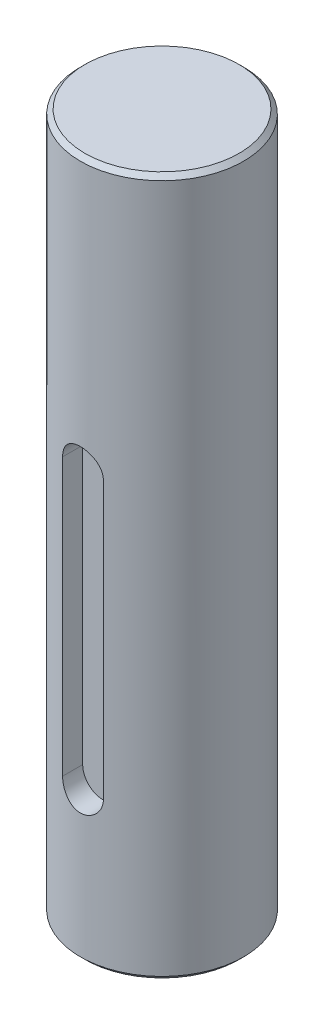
ISO-10303-21;
HEADER;
FILE_DESCRIPTION(('STEP AP214'),'2;1');
FILE_NAME('part.step','',(''),(''),'','','');
FILE_SCHEMA(('AUTOMOTIVE_DESIGN { 1 0 10303 214 1 1 1 1 }'));
ENDSEC;
DATA;
#1=APPLICATION_CONTEXT('core data for automotive mechanical design processes');
#2=APPLICATION_PROTOCOL_DEFINITION('international standard','automotive_design',2000,#1);
#3=PRODUCT_CONTEXT('',#1,'mechanical');
#4=PRODUCT('Part','Part','',(#3));
#5=PRODUCT_RELATED_PRODUCT_CATEGORY('part','',(#4));
#6=PRODUCT_DEFINITION_FORMATION('','',#4);
#7=PRODUCT_DEFINITION_CONTEXT('part definition',#1,'design');
#8=PRODUCT_DEFINITION('design','',#6,#7);
#9=PRODUCT_DEFINITION_SHAPE('','',#8);
#10=(LENGTH_UNIT() NAMED_UNIT(*) SI_UNIT(.MILLI.,.METRE.));
#11=(NAMED_UNIT(*) PLANE_ANGLE_UNIT() SI_UNIT($,.RADIAN.));
#12=(NAMED_UNIT(*) SI_UNIT($,.STERADIAN.) SOLID_ANGLE_UNIT());
#13=UNCERTAINTY_MEASURE_WITH_UNIT(LENGTH_MEASURE(1.E-05),#10,'distance_accuracy_value','');
#14=(GEOMETRIC_REPRESENTATION_CONTEXT(3) GLOBAL_UNCERTAINTY_ASSIGNED_CONTEXT((#13)) GLOBAL_UNIT_ASSIGNED_CONTEXT((#10,
#11,#12)) REPRESENTATION_CONTEXT('',''));
#15=CARTESIAN_POINT('',(0.,0.,0.));
#16=DIRECTION('',(0.,0.,1.));
#17=DIRECTION('',(1.,0.,0.));
#18=AXIS2_PLACEMENT_3D('',#15,#16,#17);
#19=CARTESIAN_POINT('',(0.,154.,0.));
#20=DIRECTION('',(0.,-1.,0.));
#21=DIRECTION('',(0.,0.,-1.));
#22=AXIS2_PLACEMENT_3D('',#19,#20,#21);
#23=CYLINDRICAL_SURFACE('',#22,18.);
#24=CARTESIAN_POINT('',(0.,0.999999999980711,0.));
#25=DIRECTION('',(0.,-1.,0.));
#26=DIRECTION('',(0.,0.,-1.));
#27=AXIS2_PLACEMENT_3D('',#24,#25,#26);
#28=CIRCLE('',#27,18.);
#29=CARTESIAN_POINT('',(0.,0.999999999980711,-18.));
#30=VERTEX_POINT('',#29);
#31=EDGE_CURVE('E11',#30,#30,#28,.F.);
#32=ORIENTED_EDGE('',*,*,#31,.T.);
#33=EDGE_LOOP('',(#32));
#34=FACE_BOUND('',#33,.T.);
#35=CARTESIAN_POINT('',(0.,153.000000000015,0.));
#36=DIRECTION('',(0.,1.,0.));
#37=DIRECTION('',(0.,0.,1.));
#38=AXIS2_PLACEMENT_3D('',#35,#36,#37);
#39=CIRCLE('',#38,18.);
#40=CARTESIAN_POINT('',(0.,153.000000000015,18.));
#41=VERTEX_POINT('',#40);
#42=EDGE_CURVE('E84',#41,#41,#39,.F.);
#43=ORIENTED_EDGE('',*,*,#42,.T.);
#44=EDGE_LOOP('',(#43));
#45=FACE_BOUND('',#44,.T.);
#46=CARTESIAN_POINT('',(-4.5,94.,17.4284250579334));
#47=CARTESIAN_POINT('',(-4.5000156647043,94.1244458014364,17.4284107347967));
#48=CARTESIAN_POINT('',(-4.49483840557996,94.2488863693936,17.4297574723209));
#49=CARTESIAN_POINT('',(-4.47421375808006,94.4968369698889,17.4350686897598));
#50=CARTESIAN_POINT('',(-4.45876809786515,94.6203471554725,17.4390327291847));
#51=CARTESIAN_POINT('',(-4.41776283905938,94.8653171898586,17.4494639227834));
#52=CARTESIAN_POINT('',(-4.39222328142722,94.9867806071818,17.4559261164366));
#53=CARTESIAN_POINT('',(-4.33124877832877,95.2270475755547,17.4711555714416));
#54=CARTESIAN_POINT('',(-4.29581369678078,95.3458510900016,17.4799228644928));
#55=CARTESIAN_POINT('',(-4.21533733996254,95.5799493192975,17.4995040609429));
#56=CARTESIAN_POINT('',(-4.17029908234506,95.6952451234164,17.5103173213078));
#57=CARTESIAN_POINT('',(-4.07096139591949,95.9216078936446,17.5336782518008));
#58=CARTESIAN_POINT('',(-4.01665853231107,96.0326732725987,17.5462265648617));
#59=CARTESIAN_POINT('',(-3.84042452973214,96.3583798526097,17.5859509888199));
#60=CARTESIAN_POINT('',(-3.70510392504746,96.5657169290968,17.6152229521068));
#61=CARTESIAN_POINT('',(-3.39966486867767,96.9589810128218,17.6767345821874));
#62=CARTESIAN_POINT('',(-3.22891361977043,97.1444059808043,17.7090213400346));
#63=CARTESIAN_POINT('',(-2.85874510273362,97.4843504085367,17.7725289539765));
#64=CARTESIAN_POINT('',(-2.65932326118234,97.6388649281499,17.8037496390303));
#65=CARTESIAN_POINT('',(-2.23405492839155,97.9146019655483,17.8621284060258));
#66=CARTESIAN_POINT('',(-2.00787872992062,98.0353301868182,17.889223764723));
#67=CARTESIAN_POINT('',(-1.53766196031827,98.2368606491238,17.935755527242));
#68=CARTESIAN_POINT('',(-1.29362491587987,98.3176707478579,17.9551934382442));
#69=CARTESIAN_POINT('',(-0.799848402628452,98.4354656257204,17.9838855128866));
#70=CARTESIAN_POINT('',(-0.550324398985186,98.4733045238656,17.9933378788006));
#71=CARTESIAN_POINT('',(-0.0482975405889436,98.5067651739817,18.0016847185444));
#72=CARTESIAN_POINT('',(0.204204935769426,98.5023922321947,18.0005805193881));
#73=CARTESIAN_POINT('',(0.699086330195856,98.4521650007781,17.9880856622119));
#74=CARTESIAN_POINT('',(0.941565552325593,98.4072335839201,17.9769238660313));
#75=CARTESIAN_POINT('',(1.41542380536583,98.2786515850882,17.9458349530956));
#76=CARTESIAN_POINT('',(1.64680234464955,98.1949992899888,17.9259074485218));
#77=CARTESIAN_POINT('',(2.09433426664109,97.9905918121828,17.8791746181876));
#78=CARTESIAN_POINT('',(2.31033087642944,97.8695076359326,17.8523086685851));
#79=CARTESIAN_POINT('',(2.71923929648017,97.5939650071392,17.7946186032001));
#80=CARTESIAN_POINT('',(2.9121476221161,97.4395015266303,17.7637938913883));
#81=CARTESIAN_POINT('',(3.27498350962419,97.0965100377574,17.7005464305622));
#82=CARTESIAN_POINT('',(3.44415128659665,96.9071759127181,17.6681030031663));
#83=CARTESIAN_POINT('',(3.67232195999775,96.6038711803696,17.6215806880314));
#84=CARTESIAN_POINT('',(3.74415534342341,96.4994750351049,17.6064208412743));
#85=CARTESIAN_POINT('',(3.87882298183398,96.2848955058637,17.5772430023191));
#86=CARTESIAN_POINT('',(3.94166070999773,96.1747143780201,17.5632245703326));
#87=CARTESIAN_POINT('',(4.05821007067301,95.9486420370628,17.5366624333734));
#88=CARTESIAN_POINT('',(4.11186651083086,95.832721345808,17.5241277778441));
#89=CARTESIAN_POINT('',(4.20917065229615,95.5966139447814,17.5010109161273));
#90=CARTESIAN_POINT('',(4.2528223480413,95.4764289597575,17.4904279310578));
#91=CARTESIAN_POINT('',(4.3297402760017,95.2327441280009,17.4715459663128));
#92=CARTESIAN_POINT('',(4.36301726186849,95.1092478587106,17.463244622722));
#93=CARTESIAN_POINT('',(4.41894832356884,94.8597824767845,17.4491755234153));
#94=CARTESIAN_POINT('',(4.44160737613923,94.7338145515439,17.4434065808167));
#95=CARTESIAN_POINT('',(4.47256077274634,94.5064682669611,17.4354927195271));
#96=CARTESIAN_POINT('',(4.48285352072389,94.4053745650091,17.4328458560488));
#97=CARTESIAN_POINT('',(4.49657044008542,94.202856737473,17.4293104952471));
#98=CARTESIAN_POINT('',(4.50000572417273,94.1014334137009,17.4284191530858));
#99=CARTESIAN_POINT('',(4.5,94.,17.4284250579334));
#100=B_SPLINE_CURVE_WITH_KNOTS('',3,(#46,#47,#48,#49,#50,#51,#52,#53,#54,#55,#56,#57,#58,#59,
#60,#61,#62,#63,#64,#65,#66,#67,#68,#69,#70,#71,#72,#73,#74,#75,#76,#77,#78,#79,#80,#81,#82,#83,
#84,#85,#86,#87,#88,#89,#90,#91,#92,#93,#94,#95,#96,#97,#98,#99),.UNSPECIFIED.,.F.,.F.,(4,2,2,2,
2,2,2,2,2,2,2,2,2,2,2,2,2,2,2,2,2,2,2,2,2,2,4),(0.,0.373214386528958,0.74636597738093,
1.11878038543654,1.49119991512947,1.86350258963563,2.23594359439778,2.98024221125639,
3.7391983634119,4.49827571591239,5.26793824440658,6.03744920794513,6.79138149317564,
7.54521900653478,8.28232437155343,9.01946235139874,9.76327275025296,10.5071952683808,
11.2711741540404,11.653682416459,12.0360425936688,12.4206261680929,12.8050559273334,
13.189085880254,13.5729356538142,13.8776487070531,14.1818675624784),.UNSPECIFIED.);
#101=CARTESIAN_POINT('',(-4.50000000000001,94.,17.4284250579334));
#102=VERTEX_POINT('',#101);
#103=CARTESIAN_POINT('',(4.5,94.,17.4284250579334));
#104=VERTEX_POINT('',#103);
#105=EDGE_CURVE('E87',#102,#104,#100,.T.);
#106=ORIENTED_EDGE('',*,*,#105,.T.);
#107=DIRECTION('',(0.,-1.,0.));
#108=VECTOR('',#107,1.);
#109=CARTESIAN_POINT('',(4.5,154.,17.4284250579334));
#110=LINE('',#109,#108);
#111=CARTESIAN_POINT('',(4.5,33.,17.4284250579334));
#112=VERTEX_POINT('',#111);
#113=EDGE_CURVE('E76',#104,#112,#110,.T.);
#114=ORIENTED_EDGE('',*,*,#113,.T.);
#115=CARTESIAN_POINT('',(4.50000000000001,33.,17.4284250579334));
#116=CARTESIAN_POINT('',(4.50001566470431,32.8755541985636,17.4284107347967));
#117=CARTESIAN_POINT('',(4.49483840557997,32.7511136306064,17.4297574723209));
#118=CARTESIAN_POINT('',(4.47421375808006,32.5031630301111,17.4350686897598));
#119=CARTESIAN_POINT('',(4.45876809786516,32.3796528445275,17.4390327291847));
#120=CARTESIAN_POINT('',(4.41776283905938,32.1346828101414,17.4494639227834));
#121=CARTESIAN_POINT('',(4.39222328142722,32.0132193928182,17.4559261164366));
#122=CARTESIAN_POINT('',(4.33124877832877,31.7729524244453,17.4711555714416));
#123=CARTESIAN_POINT('',(4.29581369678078,31.6541489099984,17.4799228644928));
#124=CARTESIAN_POINT('',(4.21533733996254,31.4200506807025,17.4995040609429));
#125=CARTESIAN_POINT('',(4.17029908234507,31.3047548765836,17.5103173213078));
#126=CARTESIAN_POINT('',(4.0709613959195,31.0783921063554,17.5336782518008));
#127=CARTESIAN_POINT('',(4.01665853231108,30.9673267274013,17.5462265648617));
#128=CARTESIAN_POINT('',(3.84042452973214,30.6416201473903,17.5859509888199));
#129=CARTESIAN_POINT('',(3.70510392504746,30.4342830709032,17.6152229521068));
#130=CARTESIAN_POINT('',(3.39966486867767,30.0410189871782,17.6767345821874));
#131=CARTESIAN_POINT('',(3.22891361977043,29.8555940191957,17.7090213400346));
#132=CARTESIAN_POINT('',(2.85874510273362,29.5156495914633,17.7725289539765));
#133=CARTESIAN_POINT('',(2.65932326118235,29.3611350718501,17.8037496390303));
#134=CARTESIAN_POINT('',(2.23405492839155,29.0853980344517,17.8621284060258));
#135=CARTESIAN_POINT('',(2.00787872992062,28.9646698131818,17.889223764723));
#136=CARTESIAN_POINT('',(1.53766196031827,28.7631393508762,17.935755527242));
#137=CARTESIAN_POINT('',(1.29362491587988,28.6823292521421,17.9551934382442));
#138=CARTESIAN_POINT('',(0.799848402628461,28.5645343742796,17.9838855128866));
#139=CARTESIAN_POINT('',(0.550324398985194,28.5266954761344,17.9933378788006));
#140=CARTESIAN_POINT('',(0.0482975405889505,28.4932348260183,18.0016847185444));
#141=CARTESIAN_POINT('',(-0.204204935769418,28.4976077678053,18.0005805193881));
#142=CARTESIAN_POINT('',(-0.699086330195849,28.5478349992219,17.9880856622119));
#143=CARTESIAN_POINT('',(-0.941565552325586,28.5927664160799,17.9769238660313));
#144=CARTESIAN_POINT('',(-1.41542380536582,28.7213484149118,17.9458349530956));
#145=CARTESIAN_POINT('',(-1.64680234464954,28.8050007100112,17.9259074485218));
#146=CARTESIAN_POINT('',(-2.09433426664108,29.0094081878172,17.8791746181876));
#147=CARTESIAN_POINT('',(-2.31033087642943,29.1304923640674,17.8523086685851));
#148=CARTESIAN_POINT('',(-2.71923929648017,29.4060349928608,17.7946186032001));
#149=CARTESIAN_POINT('',(-2.9121476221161,29.5604984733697,17.7637938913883));
#150=CARTESIAN_POINT('',(-3.27498350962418,29.9034899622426,17.7005464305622));
#151=CARTESIAN_POINT('',(-3.44415128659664,30.0928240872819,17.6681030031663));
#152=CARTESIAN_POINT('',(-3.67232195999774,30.3961288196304,17.6215806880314));
#153=CARTESIAN_POINT('',(-3.7441553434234,30.5005249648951,17.6064208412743));
#154=CARTESIAN_POINT('',(-3.87882298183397,30.7151044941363,17.5772430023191));
#155=CARTESIAN_POINT('',(-3.94166070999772,30.8252856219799,17.5632245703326));
#156=CARTESIAN_POINT('',(-4.058210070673,31.0513579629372,17.5366624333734));
#157=CARTESIAN_POINT('',(-4.11186651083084,31.167278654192,17.5241277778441));
#158=CARTESIAN_POINT('',(-4.20917065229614,31.4033860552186,17.5010109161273));
#159=CARTESIAN_POINT('',(-4.25282234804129,31.5235710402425,17.4904279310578));
#160=CARTESIAN_POINT('',(-4.32974027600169,31.7672558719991,17.4715459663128));
#161=CARTESIAN_POINT('',(-4.36301726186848,31.8907521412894,17.463244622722));
#162=CARTESIAN_POINT('',(-4.41894832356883,32.1402175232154,17.4491755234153));
#163=CARTESIAN_POINT('',(-4.44160737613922,32.2661854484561,17.4434065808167));
#164=CARTESIAN_POINT('',(-4.47256077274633,32.4935317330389,17.4354927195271));
#165=CARTESIAN_POINT('',(-4.48285352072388,32.5946254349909,17.4328458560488));
#166=CARTESIAN_POINT('',(-4.49657044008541,32.797143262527,17.4293104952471));
#167=CARTESIAN_POINT('',(-4.50000572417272,32.8985665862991,17.4284191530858));
#168=CARTESIAN_POINT('',(-4.49999999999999,33.,17.4284250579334));
#169=B_SPLINE_CURVE_WITH_KNOTS('',3,(#115,#116,#117,#118,#119,#120,#121,#122,#123,#124,#125,
#126,#127,#128,#129,#130,#131,#132,#133,#134,#135,#136,#137,#138,#139,#140,#141,#142,#143,#144,
#145,#146,#147,#148,#149,#150,#151,#152,#153,#154,#155,#156,#157,#158,#159,#160,#161,#162,#163,
#164,#165,#166,#167,#168),.UNSPECIFIED.,.F.,.F.,(4,2,2,2,2,2,2,2,2,2,2,2,2,2,2,2,2,2,2,2,2,2,2,
2,2,2,4),(0.,0.373214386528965,0.74636597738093,1.11878038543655,1.49119991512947,
1.86350258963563,2.23594359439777,2.9802422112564,3.73919836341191,4.4982757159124,
5.26793824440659,6.03744920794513,6.79138149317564,7.54521900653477,8.28232437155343,
9.01946235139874,9.76327275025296,10.5071952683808,11.2711741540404,11.653682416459,
12.0360425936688,12.4206261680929,12.8050559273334,13.189085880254,13.5729356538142,
13.8776487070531,14.1818675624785),.UNSPECIFIED.);
#170=CARTESIAN_POINT('',(-4.49999999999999,33.,17.4284250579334));
#171=VERTEX_POINT('',#170);
#172=EDGE_CURVE('E96',#112,#171,#169,.T.);
#173=ORIENTED_EDGE('',*,*,#172,.T.);
#174=DIRECTION('',(0.,-1.,0.));
#175=VECTOR('',#174,1.);
#176=CARTESIAN_POINT('',(-4.50000000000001,154.,17.4284250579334));
#177=LINE('',#176,#175);
#178=EDGE_CURVE('E92',#171,#102,#177,.F.);
#179=ORIENTED_EDGE('',*,*,#178,.T.);
#180=EDGE_LOOP('',(#106,#114,#173,#179));
#181=FACE_BOUND('',#180,.T.);
#182=ADVANCED_FACE('F37',(#34,#45,#181),#23,.T.);
#183=CARTESIAN_POINT('',(18.,154.,0.));
#184=DIRECTION('',(0.,1.,0.));
#185=DIRECTION('',(0.,0.,1.));
#186=AXIS2_PLACEMENT_3D('',#183,#184,#185);
#187=PLANE('',#186);
#188=CARTESIAN_POINT('',(0.,154.,0.));
#189=DIRECTION('',(0.,1.,0.));
#190=DIRECTION('',(0.,0.,1.));
#191=AXIS2_PLACEMENT_3D('',#188,#189,#190);
#192=CIRCLE('',#191,16.999999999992);
#193=CARTESIAN_POINT('',(0.,154.,16.999999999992));
#194=VERTEX_POINT('',#193);
#195=EDGE_CURVE('E143',#194,#194,#192,.T.);
#196=ORIENTED_EDGE('',*,*,#195,.T.);
#197=EDGE_LOOP('',(#196));
#198=FACE_BOUND('',#197,.T.);
#199=ADVANCED_FACE('F131',(#198),#187,.T.);
#200=CARTESIAN_POINT('',(0.,0.,0.));
#201=DIRECTION('',(0.,-1.,0.));
#202=DIRECTION('',(0.,0.,-1.));
#203=AXIS2_PLACEMENT_3D('',#200,#201,#202);
#204=PLANE('',#203);
#205=CARTESIAN_POINT('',(0.,0.,0.));
#206=DIRECTION('',(0.,-1.,0.));
#207=DIRECTION('',(0.,0.,-1.));
#208=AXIS2_PLACEMENT_3D('',#205,#206,#207);
#209=CIRCLE('',#208,16.9999999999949);
#210=CARTESIAN_POINT('',(0.,0.,-16.9999999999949));
#211=VERTEX_POINT('',#210);
#212=EDGE_CURVE('E44',#211,#211,#209,.T.);
#213=ORIENTED_EDGE('',*,*,#212,.T.);
#214=EDGE_LOOP('',(#213));
#215=FACE_BOUND('',#214,.T.);
#216=ADVANCED_FACE('F136',(#215),#204,.T.);
#217=CARTESIAN_POINT('',(0.,94.,18.001));
#218=DIRECTION('',(0.,0.,-1.));
#219=DIRECTION('',(-1.,0.,0.));
#220=AXIS2_PLACEMENT_3D('',#217,#218,#219);
#221=CYLINDRICAL_SURFACE('',#220,4.5);
#222=DIRECTION('',(0.,0.,-1.));
#223=VECTOR('',#222,1.);
#224=CARTESIAN_POINT('',(-4.5,94.,18.001));
#225=LINE('',#224,#223);
#226=CARTESIAN_POINT('',(-4.5,94.,13.));
#227=VERTEX_POINT('',#226);
#228=EDGE_CURVE('E59',#102,#227,#225,.T.);
#229=ORIENTED_EDGE('',*,*,#228,.T.);
#230=CARTESIAN_POINT('',(0.,94.,13.));
#231=DIRECTION('',(0.,0.,-1.));
#232=DIRECTION('',(-1.,0.,0.));
#233=AXIS2_PLACEMENT_3D('',#230,#231,#232);
#234=CIRCLE('',#233,4.5);
#235=CARTESIAN_POINT('',(4.5,94.,13.));
#236=VERTEX_POINT('',#235);
#237=EDGE_CURVE('E88',#227,#236,#234,.T.);
#238=ORIENTED_EDGE('',*,*,#237,.T.);
#239=DIRECTION('',(0.,0.,-1.));
#240=VECTOR('',#239,1.);
#241=CARTESIAN_POINT('',(4.5,94.,18.001));
#242=LINE('',#241,#240);
#243=EDGE_CURVE('E79',#104,#236,#242,.T.);
#244=ORIENTED_EDGE('',*,*,#243,.F.);
#245=ORIENTED_EDGE('',*,*,#105,.F.);
#246=EDGE_LOOP('',(#229,#238,#244,#245));
#247=FACE_BOUND('',#246,.T.);
#248=ADVANCED_FACE('F86',(#247),#221,.F.);
#249=CARTESIAN_POINT('',(-4.49999999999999,33.,18.001));
#250=DIRECTION('',(-1.,0.,0.));
#251=DIRECTION('',(0.,-1.,0.));
#252=AXIS2_PLACEMENT_3D('',#249,#250,#251);
#253=PLANE('',#252);
#254=DIRECTION('',(0.,0.,-1.));
#255=VECTOR('',#254,1.);
#256=CARTESIAN_POINT('',(-4.49999999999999,33.,18.001));
#257=LINE('',#256,#255);
#258=CARTESIAN_POINT('',(-4.49999999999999,33.,13.));
#259=VERTEX_POINT('',#258);
#260=EDGE_CURVE('E211',#171,#259,#257,.T.);
#261=ORIENTED_EDGE('',*,*,#260,.T.);
#262=DIRECTION('',(0.,1.,0.));
#263=VECTOR('',#262,1.);
#264=CARTESIAN_POINT('',(-4.49999999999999,33.,13.));
#265=LINE('',#264,#263);
#266=EDGE_CURVE('E89',#259,#227,#265,.T.);
#267=ORIENTED_EDGE('',*,*,#266,.T.);
#268=ORIENTED_EDGE('',*,*,#228,.F.);
#269=ORIENTED_EDGE('',*,*,#178,.F.);
#270=EDGE_LOOP('',(#261,#267,#268,#269));
#271=FACE_BOUND('',#270,.T.);
#272=ADVANCED_FACE('F123',(#271),#253,.F.);
#273=CARTESIAN_POINT('',(0.,33.,18.001));
#274=DIRECTION('',(0.,0.,-1.));
#275=DIRECTION('',(-1.,0.,0.));
#276=AXIS2_PLACEMENT_3D('',#273,#274,#275);
#277=CYLINDRICAL_SURFACE('',#276,4.5);
#278=DIRECTION('',(0.,0.,-1.));
#279=VECTOR('',#278,1.);
#280=CARTESIAN_POINT('',(4.50000000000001,33.,18.001));
#281=LINE('',#280,#279);
#282=CARTESIAN_POINT('',(4.50000000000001,33.,13.));
#283=VERTEX_POINT('',#282);
#284=EDGE_CURVE('E51',#112,#283,#281,.T.);
#285=ORIENTED_EDGE('',*,*,#284,.T.);
#286=CARTESIAN_POINT('',(0.,33.,13.));
#287=DIRECTION('',(0.,0.,-1.));
#288=DIRECTION('',(-1.,0.,0.));
#289=AXIS2_PLACEMENT_3D('',#286,#287,#288);
#290=CIRCLE('',#289,4.5);
#291=EDGE_CURVE('E216',#283,#259,#290,.T.);
#292=ORIENTED_EDGE('',*,*,#291,.T.);
#293=ORIENTED_EDGE('',*,*,#260,.F.);
#294=ORIENTED_EDGE('',*,*,#172,.F.);
#295=EDGE_LOOP('',(#285,#292,#293,#294));
#296=FACE_BOUND('',#295,.T.);
#297=ADVANCED_FACE('F120',(#296),#277,.F.);
#298=CARTESIAN_POINT('',(4.5,94.,18.001));
#299=DIRECTION('',(1.,0.,0.));
#300=DIRECTION('',(0.,1.,0.));
#301=AXIS2_PLACEMENT_3D('',#298,#299,#300);
#302=PLANE('',#301);
#303=ORIENTED_EDGE('',*,*,#243,.T.);
#304=DIRECTION('',(0.,-1.,0.));
#305=VECTOR('',#304,1.);
#306=CARTESIAN_POINT('',(4.5,94.,13.));
#307=LINE('',#306,#305);
#308=EDGE_CURVE('E94',#236,#283,#307,.T.);
#309=ORIENTED_EDGE('',*,*,#308,.T.);
#310=ORIENTED_EDGE('',*,*,#284,.F.);
#311=ORIENTED_EDGE('',*,*,#113,.F.);
#312=EDGE_LOOP('',(#303,#309,#310,#311));
#313=FACE_BOUND('',#312,.T.);
#314=ADVANCED_FACE('F78',(#313),#302,.F.);
#315=CARTESIAN_POINT('',(0.,94.,13.));
#316=DIRECTION('',(0.,0.,-1.));
#317=DIRECTION('',(-1.,0.,0.));
#318=AXIS2_PLACEMENT_3D('',#315,#316,#317);
#319=PLANE('',#318);
#320=ORIENTED_EDGE('',*,*,#237,.F.);
#321=ORIENTED_EDGE('',*,*,#266,.F.);
#322=ORIENTED_EDGE('',*,*,#291,.F.);
#323=ORIENTED_EDGE('',*,*,#308,.F.);
#324=EDGE_LOOP('',(#320,#321,#322,#323));
#325=FACE_BOUND('',#324,.T.);
#326=ADVANCED_FACE('F113',(#325),#319,.F.);
#327=CARTESIAN_POINT('',(0.,153.000000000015,0.));
#328=DIRECTION('',(0.,-1.,0.));
#329=DIRECTION('',(0.,0.,-1.));
#330=AXIS2_PLACEMENT_3D('',#327,#328,#329);
#331=CONICAL_SURFACE('',#330,18.,0.785398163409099);
#332=ORIENTED_EDGE('',*,*,#195,.F.);
#333=EDGE_LOOP('',(#332));
#334=FACE_BOUND('',#333,.T.);
#335=ORIENTED_EDGE('',*,*,#42,.F.);
#336=EDGE_LOOP('',(#335));
#337=FACE_BOUND('',#336,.T.);
#338=ADVANCED_FACE('F111',(#334,#337),#331,.T.);
#339=CARTESIAN_POINT('',(0.,0.,0.));
#340=DIRECTION('',(0.,1.,0.));
#341=DIRECTION('',(0.,0.,1.));
#342=AXIS2_PLACEMENT_3D('',#339,#340,#341);
#343=CONICAL_SURFACE('',#342,16.9999999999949,0.785398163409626);
#344=ORIENTED_EDGE('',*,*,#31,.F.);
#345=EDGE_LOOP('',(#344));
#346=FACE_BOUND('',#345,.T.);
#347=ORIENTED_EDGE('',*,*,#212,.F.);
#348=EDGE_LOOP('',(#347));
#349=FACE_BOUND('',#348,.T.);
#350=ADVANCED_FACE('F151',(#346,#349),#343,.T.);
#351=CLOSED_SHELL('',(#182,#199,#216,#248,#272,#297,#314,#326,#338,#350));
#352=MANIFOLD_SOLID_BREP('B2',#351);
#353=ADVANCED_BREP_SHAPE_REPRESENTATION('',(#18,#352),#14);
#354=SHAPE_DEFINITION_REPRESENTATION(#9,#353);
ENDSEC;
END-ISO-10303-21;
